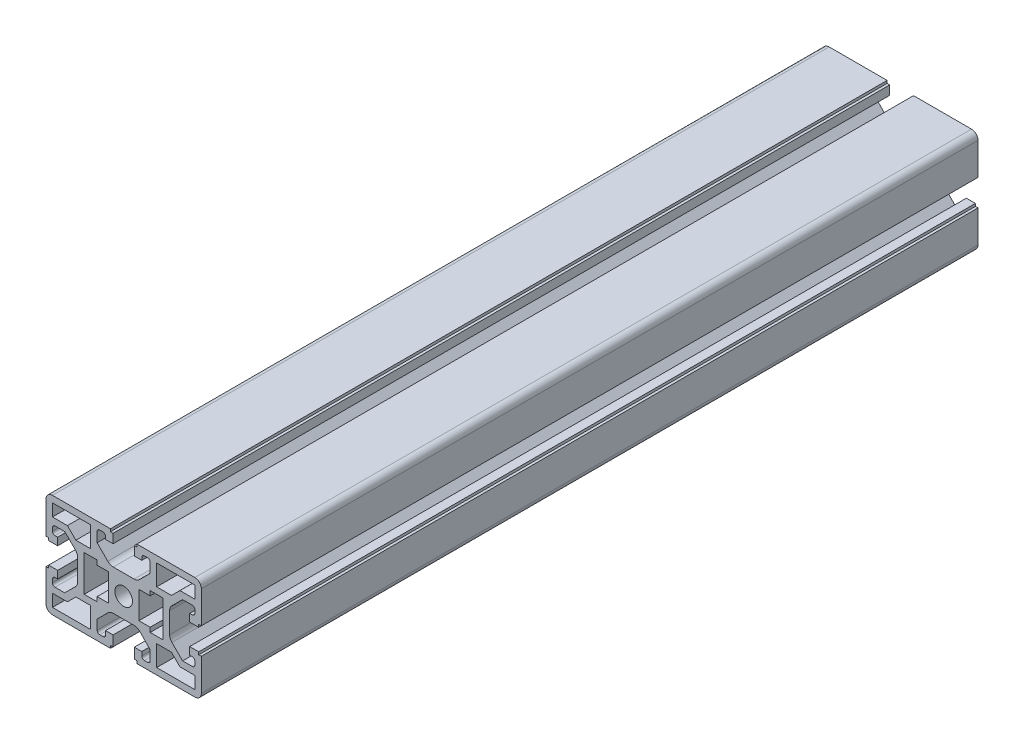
from build123d import *

# Parameters (mm, degrees)
SKETCH_1_R      = 3.4
EXTRUDE_1_DEPTH = 150


with BuildPart() as part:
    # Sketch 1 → Extrude 1 (new, symmetric)
    with BuildSketch(Plane.XY):
        with BuildLine():
            Line((-4.020871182, -7.75), (4.020871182, -7.75))
            ThreePointArc((4.020871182, -7.75), (5.17375715, -7.980369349), (6.149583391, -8.63609737))
            Line((6.149583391, -8.63609737), (10.25, -12.765240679))
            Line((10.25, -12.765240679), (10.25, -16.5))
            ThreePointArc((10.25, -16.5), (9.957106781, -17.207106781), (9.25, -17.5))
            Line((9.25, -17.5), (8, -17.5))
            ThreePointArc((8, -17.5), (7.292893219, -17.207106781), (7, -16.5))
            Line((7, -16.5), (7, -15))
            Line((7, -15), (4.1, -15))
            Line((4.1, -15), (4.1, -19))
            Line((4.1, -19), (5.1, -19))
            Line((5.1, -19), (5.1, -20))
            Line((5.1, -20), (27.5, -20))
            ThreePointArc((27.5, -20), (29.267766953, -19.267766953), (30, -17.5))
            Line((30, -17.5), (30, -5.1))
            Line((30, -5.1), (29, -5.1))
            Line((29, -5.1), (29, -4.1))
            Line((29, -4.1), (25.5, -4.1))
            Line((25.5, -4.1), (25.5, -7))
            Line((25.5, -7), (26.5, -7))
            ThreePointArc((26.5, -7), (27.207106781, -7.292893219), (27.5, -8))
            Line((27.5, -8), (27.5, -9.25))
            ThreePointArc((27.5, -9.25), (27.207106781, -9.957106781), (26.5, -10.25))
            Line((26.5, -10.25), (22.765240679, -10.25))
            Line((22.765240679, -10.25), (18.63609737, -6.149583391))
            ThreePointArc((18.63609737, -6.149583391), (17.980369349, -5.17375715), (17.75, -4.020871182))
            Line((17.75, -4.020871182), (17.75, 4.020871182))
            ThreePointArc((17.75, 4.020871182), (17.980369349, 5.17375715), (18.63609737, 6.149583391))
            Line((18.63609737, 6.149583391), (22.765240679, 10.25))
            Line((22.765240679, 10.25), (26.5, 10.25))
            ThreePointArc((26.5, 10.25), (27.207106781, 9.957106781), (27.5, 9.25))
            Line((27.5, 9.25), (27.5, 8))
            ThreePointArc((27.5, 8), (27.207106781, 7.292893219), (26.5, 7))
            Line((26.5, 7), (25.5, 7))
            Line((25.5, 7), (25.5, 4.1))
            Line((25.5, 4.1), (29, 4.1))
            Line((29, 4.1), (29, 5.1))
            Line((29, 5.1), (30, 5.1))
            Line((30, 5.1), (30, 17.5))
            ThreePointArc((30, 17.5), (29.267766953, 19.267766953), (27.5, 20))
            Line((27.5, 20), (5.1, 20))
            Line((5.1, 20), (5.1, 19))
            Line((5.1, 19), (4.1, 19))
            Line((4.1, 19), (4.1, 15.5))
            Line((4.1, 15.5), (7, 15.5))
            Line((7, 15.5), (7, 16.5))
            ThreePointArc((7, 16.5), (7.292893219, 17.207106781), (8, 17.5))
            Line((8, 17.5), (9.25, 17.5))
            ThreePointArc((9.25, 17.5), (9.957106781, 17.207106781), (10.25, 16.5))
            Line((10.25, 16.5), (10.25, 12.765240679))
            Line((10.25, 12.765240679), (6.149583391, 8.63609737))
            ThreePointArc((6.149583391, 8.63609737), (5.17375715, 7.980369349), (4.020871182, 7.75))
            Line((4.020871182, 7.75), (-4.020871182, 7.75))
            ThreePointArc((-4.020871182, 7.75), (-5.17375715, 7.980369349), (-6.149583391, 8.63609737))
            Line((-6.149583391, 8.63609737), (-10.25, 12.765240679))
            Line((-10.25, 12.765240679), (-10.25, 16.5))
            ThreePointArc((-10.25, 16.5), (-9.957106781, 17.207106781), (-9.25, 17.5))
            Line((-9.25, 17.5), (-8, 17.5))
            ThreePointArc((-8, 17.5), (-7.292893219, 17.207106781), (-7, 16.5))
            Line((-7, 16.5), (-7, 15.5))
            Line((-7, 15.5), (-4.1, 15.5))
            Line((-4.1, 15.5), (-4.1, 19))
            Line((-4.1, 19), (-5.1, 19))
            Line((-5.1, 19), (-5.1, 20))
            Line((-5.1, 20), (-27.5, 20))
            ThreePointArc((-27.5, 20), (-29.267766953, 19.267766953), (-30, 17.5))
            Line((-30, 17.5), (-30, 5.1))
            Line((-30, 5.1), (-29, 5.1))
            Line((-29, 5.1), (-29, 4.1))
            Line((-29, 4.1), (-25.5, 4.1))
            Line((-25.5, 4.1), (-25.5, 7))
            Line((-25.5, 7), (-26.5, 7))
            ThreePointArc((-26.5, 7), (-27.207106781, 7.292893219), (-27.5, 8))
            Line((-27.5, 8), (-27.5, 9.25))
            ThreePointArc((-27.5, 9.25), (-27.207106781, 9.957106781), (-26.5, 10.25))
            Line((-26.5, 10.25), (-22.765240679, 10.25))
            Line((-22.765240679, 10.25), (-18.63609737, 6.149583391))
            ThreePointArc((-18.63609737, 6.149583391), (-17.980369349, 5.17375715), (-17.75, 4.020871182))
            Line((-17.75, 4.020871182), (-17.75, -4.020871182))
            ThreePointArc((-17.75, -4.020871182), (-17.980369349, -5.17375715), (-18.63609737, -6.149583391))
            Line((-18.63609737, -6.149583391), (-22.765240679, -10.25))
            Line((-22.765240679, -10.25), (-26.5, -10.25))
            ThreePointArc((-26.5, -10.25), (-27.207106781, -9.957106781), (-27.5, -9.25))
            Line((-27.5, -9.25), (-27.5, -8))
            ThreePointArc((-27.5, -8), (-27.207106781, -7.292893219), (-26.5, -7))
            Line((-26.5, -7), (-25.5, -7))
            Line((-25.5, -7), (-25.5, -4.1))
            Line((-25.5, -4.1), (-29, -4.1))
            Line((-29, -4.1), (-29, -5.1))
            Line((-29, -5.1), (-30, -5.1))
            Line((-30, -5.1), (-30, -17.5))
            ThreePointArc((-30, -17.5), (-29.267766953, -19.267766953), (-27.5, -20))
            Line((-27.5, -20), (-5.1, -20))
            Line((-5.1, -20), (-5.1, -19))
            Line((-5.1, -19), (-4.1, -19))
            Line((-4.1, -19), (-4.1, -15))
            Line((-4.1, -15), (-7, -15))
            Line((-7, -15), (-7, -16.5))
            ThreePointArc((-7, -16.5), (-7.292893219, -17.207106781), (-8, -17.5))
            Line((-8, -17.5), (-9.25, -17.5))
            ThreePointArc((-9.25, -17.5), (-9.957106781, -17.207106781), (-10.25, -16.5))
            Line((-10.25, -16.5), (-10.25, -12.765240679))
            Line((-10.25, -12.765240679), (-6.149583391, -8.63609737))
            ThreePointArc((-6.149583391, -8.63609737), (-5.17375715, -7.980369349), (-4.020871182, -7.75))
        make_face()
        Circle(SKETCH_1_R, mode=Mode.SUBTRACT)
        Polygon((5.9, 5.25), (10.25, 5.25), (10.25, 7), (15.25, 7), (15.25, -7), (10.25, -7), (10.25, -5.25), (5.9, -5.25), align=None, mode=Mode.SUBTRACT)
        Polygon((-27.5, 17.5), (-12.75, 17.5), (-12.75, 9.5), (-18.462046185, 9.5), (-21.734815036, 12.75), (-27.5, 12.75), align=None, mode=Mode.SUBTRACT)
        Polygon((-10.25, 7), (-10.25, 5.25), (-5.9, 5.25), (-5.9, -5.25), (-10.25, -5.25), (-10.25, -7), (-15.25, -7), (-15.25, 7), align=None, mode=Mode.SUBTRACT)
        Polygon((27.5, 17.5), (12.75, 17.5), (12.75, 9.5), (18.462046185, 9.5), (21.734815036, 12.75), (27.5, 12.75), align=None, mode=Mode.SUBTRACT)
        Polygon((-27.5, -17.5), (-12.75, -17.5), (-12.75, -9.5), (-18.462046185, -9.5), (-21.734815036, -12.75), (-27.5, -12.75), align=None, mode=Mode.SUBTRACT)
        Polygon((27.5, -17.5), (12.75, -17.5), (12.75, -9.5), (18.462046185, -9.5), (21.734815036, -12.75), (27.5, -12.75), align=None, mode=Mode.SUBTRACT)
    extrude(amount=EXTRUDE_1_DEPTH, both=True)


solid = part.part
